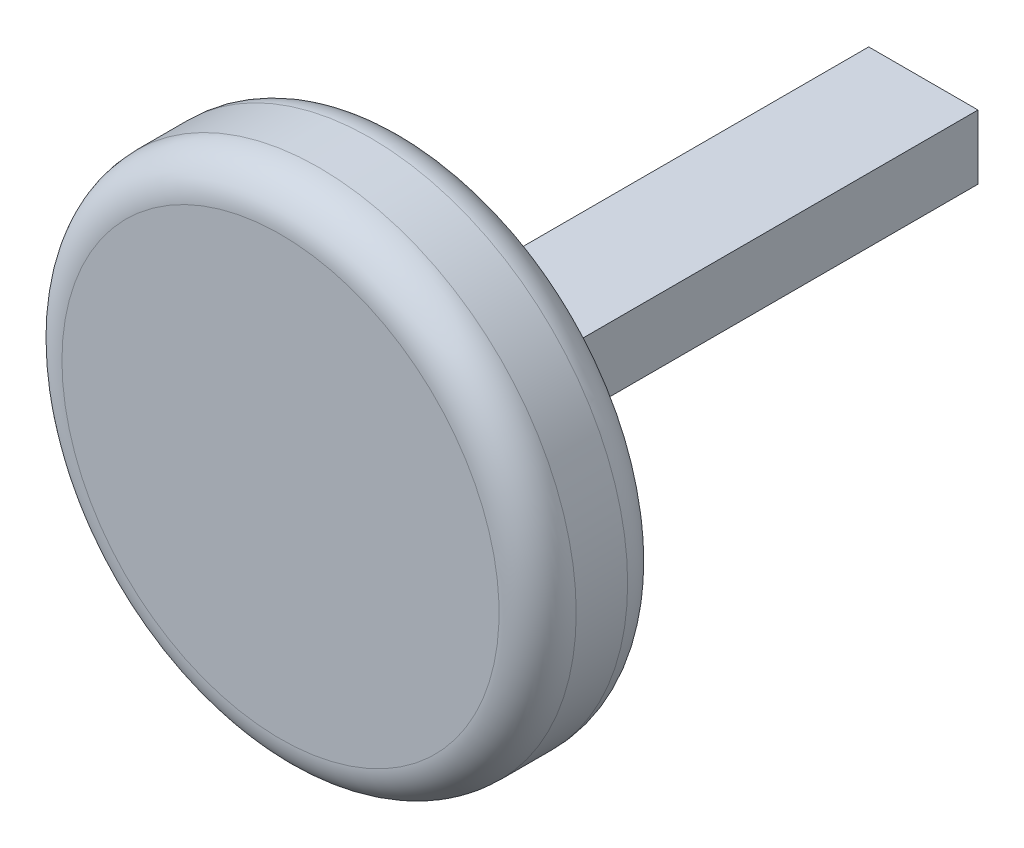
from build123d import *

# Parameters (mm, degrees)
ESQUISSE1_W        = 17
ESQUISSE1_H        = 10
BOSS_EXTRU_1_DEPTH = 100


with BuildPart() as part:
    # Esquisse1 → Boss.-Extru.1 (new body)
    with BuildSketch(Plane.XY):
        Rectangle(ESQUISSE1_W, ESQUISSE1_H)
    extrude(amount=BOSS_EXTRU_1_DEPTH)

    # Esquisse2 → R_volution1 (revolve)
    with BuildSketch(Plane(origin=(0, 0, 0), x_dir=(1, 0, 0), z_dir=(0, 1, 0)), mode=Mode.PRIVATE) as r_volution1_sk:
        with BuildLine():
            Line((0, -80), (34, -80))
            ThreePointArc((34, -80), (38.242640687, -81.757359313), (40, -86))
            Line((40, -86), (40, -94))
            ThreePointArc((40, -94), (38.242640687, -98.242640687), (34, -100))
            Line((34, -100), (0, -100))
            Line((0, -100), (0, -80))
        make_face()
    revolve(r_volution1_sk.sketch.rotate(Axis((0, 0, 80), (0, 0, 1)), 180), axis=Axis((0, 0, 80), (0, 0, 1)))


solid = part.part
